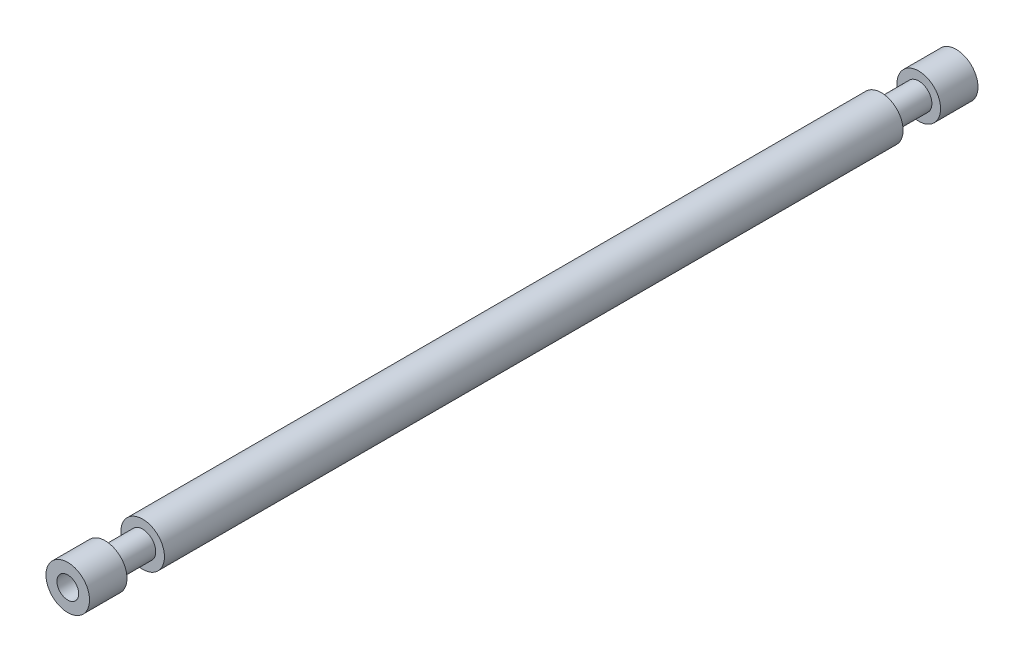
from build123d import *

# Parameters (mm, degrees)
SKETCH1_R          = 6.35
BASE_EXTRUDE_DEPTH = 259.08
SKETCH2_R          = 7.035220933
SKETCH2_R_2        = 3.81
CUT_EXTRUDE1_DEPTH = 10.922
SKETCH3_R          = 6.779676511
SKETCH3_R_2        = 3.829900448
CUT_EXTRUDE2_DEPTH = 10.922


with BuildPart() as part:
    # Sketch1 → Base-Extrude (new body)
    with BuildSketch(Plane.XY):
        with Locations(Location((0, 0, 0), (0, 0, 180))):
            Circle(SKETCH1_R)
    extrude(amount=BASE_EXTRUDE_DEPTH)

    # Sketch2 → Cut-Extrude1 (cut)
    with BuildSketch(Plane.XY.offset(248.158)):
        Circle(SKETCH2_R)
        Circle(SKETCH2_R_2, mode=Mode.SUBTRACT)
    extrude(amount=-CUT_EXTRUDE1_DEPTH, mode=Mode.SUBTRACT)

    # Sketch3 → Cut-Extrude2 (cut)
    with BuildSketch(Plane(origin=(0, 0, 10.922), x_dir=(-1, 0, 0), z_dir=(0, 0, -1))):
        Circle(SKETCH3_R)
        Circle(SKETCH3_R_2, mode=Mode.SUBTRACT)
    extrude(amount=-CUT_EXTRUDE2_DEPTH, mode=Mode.SUBTRACT)

    # Sketch4 → 1_4-20 Tapped Hole 1 (revolve, cut)
    with BuildSketch(Plane(origin=(0.003085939, -0.011311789, 0), x_dir=(0, 1, 0), z_dir=(1, 0, 0))):
        Polygon((0, 0), (0, 25.399978), (2.552697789, 23.866162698), (2.552697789, 0.002539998), (2.552697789, 0), align=None)
    revolve(axis=Axis((0.003085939, -0.011311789, 0), (0, 0, 1)), mode=Mode.SUBTRACT)

    # Sketch10 → 1_4-20 Tapped Hole 4 (revolve, cut)
    with BuildSketch(Plane(origin=(0.01449438, 0.004571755, 259.08), x_dir=(0, -1, 0), z_dir=(1, 0, 0))):
        Polygon((0, 0), (0, 12.699989), (2.552697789, 11.166173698), (2.552697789, 11.4299901), (3.17499725, 11.4299901), (3.17499725, 0.002539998), (3.17499725, 0), align=None)
    revolve(axis=Axis((0.01449438, 0.004571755, 259.08), (0, 0, -1)), mode=Mode.SUBTRACT)


solid = part.part
